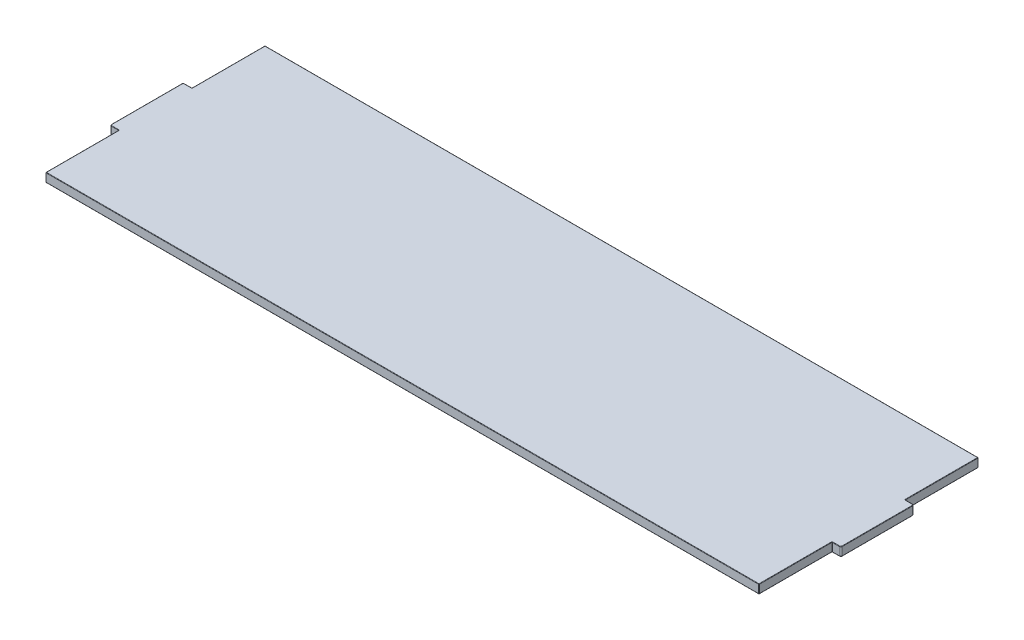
from build123d import *

# Parameters (mm, degrees)
BOSS_EXTRUDE1_DEPTH = 12
FILLET1_R           = 2
FILLET2_R           = 0.5


with BuildPart() as part:
    # Sketch2 → Boss-Extrude1 (new body)
    with BuildSketch(Plane(origin=(0, 0, 0), x_dir=(1, 0, 0), z_dir=(0, 1, 0))):
        Polygon((-488, 150), (488, 150), (488, 50), (500, 50), (500, -50), (488, -50), (488, -150), (-488, -150), (-488, -50), (-500, -50), (-500, 50), (-488, 50), align=None)
    extrude(amount=BOSS_EXTRUDE1_DEPTH)

    # Fillet1
    fillet1_edges = [part.edges().sort_by_distance(p)[0] for p in [
        (-500, 6, 50),
        (-500, 6, -50),
        (500, 6, -50),
        (500, 6, 50),
    ]]
    fillet(fillet1_edges, radius=FILLET1_R)

    # Fillet2
    fillet2_edges = [part.edges().sort_by_distance(p)[0] for p in [
        (0, 0, 150),
        (-488, 0, 100),
        (-493, 0, -50),
        (-488, 0, -100),
        (0, 0, -150),
        (488, 0, -100),
        (493, 0, 50),
        (488, 0, 100),
        (488, 12, -100),
        (0, 12, -150),
        (488, 6, 150),
        (-488, 6, 150),
        (-488, 6, 50),
        (-488, 6, -50),
        (-488, 6, -150),
        (488, 6, -150),
        (488, 6, -50),
        (488, 6, 50),
        (-488, 12, -100),
        (-493, 12, -50),
        (-488, 12, 100),
        (0, 12, 150),
        (488, 12, 100),
        (-500, 0, 0),
        (-500, 12, 0),
        (493, 12, 50),
        (-493, 0, 50),
        (493, 0, -50),
        (500, 0, 0),
        (499.414213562, 0, 49.414213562),
        (499.414213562, 0, -49.414213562),
        (-499.414213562, 0, 49.414213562),
        (-499.414213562, 0, -49.414213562),
        (500, 12, 0),
        (493, 12, -50),
        (-493, 12, 50),
        (499.414213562, 12, 49.414213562),
        (499.414213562, 12, -49.414213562),
        (-499.414213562, 12, 49.414213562),
        (-499.414213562, 12, -49.414213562),
    ]]
    fillet(fillet2_edges, radius=FILLET2_R)


solid = part.part
